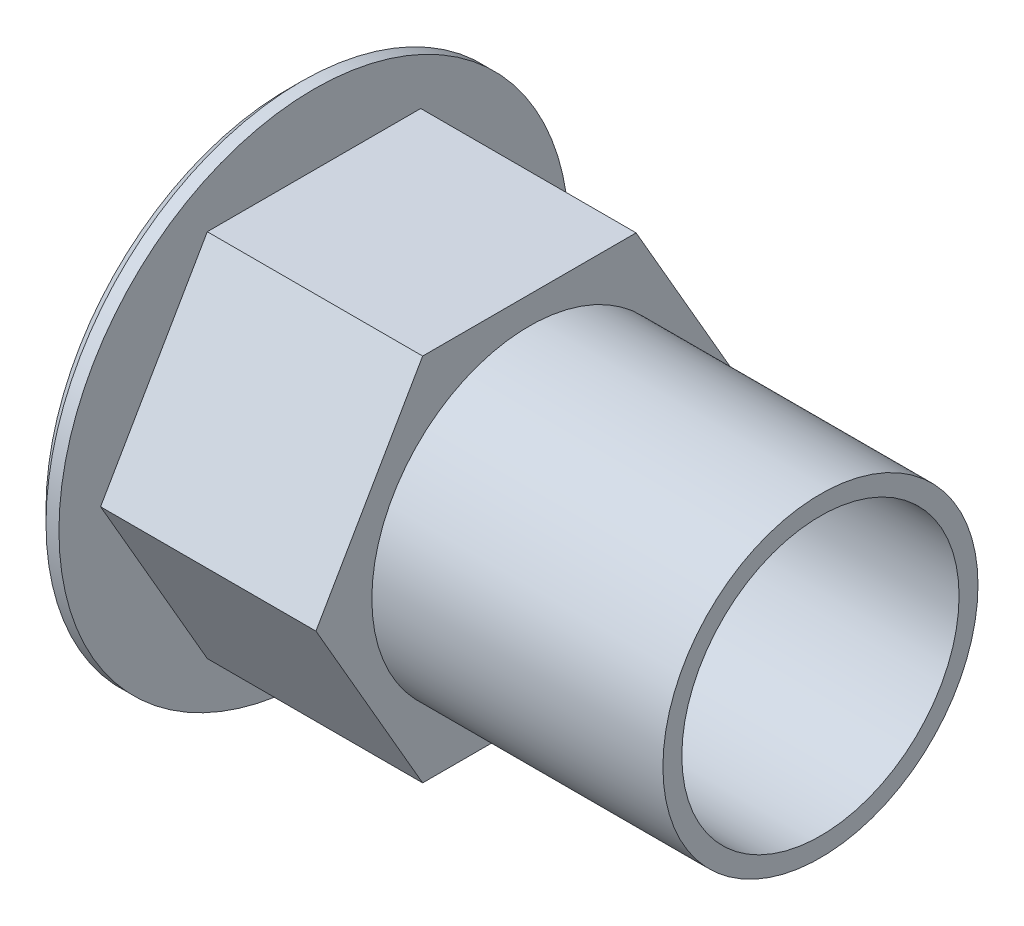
ISO-10303-21;
HEADER;
FILE_DESCRIPTION(('STEP AP214'),'2;1');
FILE_NAME('part.step','',(''),(''),'','','');
FILE_SCHEMA(('AUTOMOTIVE_DESIGN { 1 0 10303 214 1 1 1 1 }'));
ENDSEC;
DATA;
#1=APPLICATION_CONTEXT('core data for automotive mechanical design processes');
#2=APPLICATION_PROTOCOL_DEFINITION('international standard','automotive_design',2000,#1);
#3=PRODUCT_CONTEXT('',#1,'mechanical');
#4=PRODUCT('Part','Part','',(#3));
#5=PRODUCT_RELATED_PRODUCT_CATEGORY('part','',(#4));
#6=PRODUCT_DEFINITION_FORMATION('','',#4);
#7=PRODUCT_DEFINITION_CONTEXT('part definition',#1,'design');
#8=PRODUCT_DEFINITION('design','',#6,#7);
#9=PRODUCT_DEFINITION_SHAPE('','',#8);
#10=(LENGTH_UNIT() NAMED_UNIT(*) SI_UNIT(.MILLI.,.METRE.));
#11=(NAMED_UNIT(*) PLANE_ANGLE_UNIT() SI_UNIT($,.RADIAN.));
#12=(NAMED_UNIT(*) SI_UNIT($,.STERADIAN.) SOLID_ANGLE_UNIT());
#13=UNCERTAINTY_MEASURE_WITH_UNIT(LENGTH_MEASURE(1.E-05),#10,'distance_accuracy_value','');
#14=(GEOMETRIC_REPRESENTATION_CONTEXT(3) GLOBAL_UNCERTAINTY_ASSIGNED_CONTEXT((#13)) GLOBAL_UNIT_ASSIGNED_CONTEXT((#10,
#11,#12)) REPRESENTATION_CONTEXT('',''));
#15=CARTESIAN_POINT('',(0.,0.,0.));
#16=DIRECTION('',(0.,0.,1.));
#17=DIRECTION('',(1.,0.,0.));
#18=AXIS2_PLACEMENT_3D('',#15,#16,#17);
#19=CARTESIAN_POINT('',(0.889,8.763,0.));
#20=DIRECTION('',(-1.,0.,0.));
#21=DIRECTION('',(0.,0.,1.));
#22=AXIS2_PLACEMENT_3D('',#19,#20,#21);
#23=PLANE('',#22);
#24=CARTESIAN_POINT('',(0.889,0.,0.));
#25=DIRECTION('',(-1.,0.,0.));
#26=DIRECTION('',(0.,0.,1.));
#27=AXIS2_PLACEMENT_3D('',#24,#25,#26);
#28=CIRCLE('',#27,8.763);
#29=CARTESIAN_POINT('',(0.889,0.,8.763));
#30=VERTEX_POINT('',#29);
#31=EDGE_CURVE('E137',#30,#30,#28,.T.);
#32=ORIENTED_EDGE('',*,*,#31,.F.);
#33=EDGE_LOOP('',(#32));
#34=FACE_BOUND('',#33,.T.);
#35=DIRECTION('',(0.,0.866025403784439,-0.5));
#36=VECTOR('',#35,1.);
#37=CARTESIAN_POINT('',(0.889,-6.35,-3.66617420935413));
#38=LINE('',#37,#36);
#39=CARTESIAN_POINT('',(0.889,-6.35,-3.66617420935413));
#40=VERTEX_POINT('',#39);
#41=CARTESIAN_POINT('',(0.889,0.,-7.33234841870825));
#42=VERTEX_POINT('',#41);
#43=EDGE_CURVE('E85',#40,#42,#38,.T.);
#44=ORIENTED_EDGE('',*,*,#43,.F.);
#45=DIRECTION('',(0.,0.,-1.));
#46=VECTOR('',#45,1.);
#47=CARTESIAN_POINT('',(0.889,-6.35,3.66617420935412));
#48=LINE('',#47,#46);
#49=CARTESIAN_POINT('',(0.889,-6.35,3.66617420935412));
#50=VERTEX_POINT('',#49);
#51=EDGE_CURVE('E87',#50,#40,#48,.T.);
#52=ORIENTED_EDGE('',*,*,#51,.F.);
#53=DIRECTION('',(0.,-0.866025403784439,-0.5));
#54=VECTOR('',#53,1.);
#55=CARTESIAN_POINT('',(0.889,0.,7.33234841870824));
#56=LINE('',#55,#54);
#57=CARTESIAN_POINT('',(0.889,0.,7.33234841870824));
#58=VERTEX_POINT('',#57);
#59=EDGE_CURVE('E103',#58,#50,#56,.T.);
#60=ORIENTED_EDGE('',*,*,#59,.F.);
#61=DIRECTION('',(0.,-0.866025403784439,0.5));
#62=VECTOR('',#61,1.);
#63=CARTESIAN_POINT('',(0.889,6.35,3.66617420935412));
#64=LINE('',#63,#62);
#65=CARTESIAN_POINT('',(0.889,6.35,3.66617420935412));
#66=VERTEX_POINT('',#65);
#67=EDGE_CURVE('E210',#66,#58,#64,.T.);
#68=ORIENTED_EDGE('',*,*,#67,.F.);
#69=DIRECTION('',(0.,0.,1.));
#70=VECTOR('',#69,1.);
#71=CARTESIAN_POINT('',(0.889,6.35,-3.66617420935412));
#72=LINE('',#71,#70);
#73=CARTESIAN_POINT('',(0.889,6.35,-3.66617420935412));
#74=VERTEX_POINT('',#73);
#75=EDGE_CURVE('E56',#74,#66,#72,.T.);
#76=ORIENTED_EDGE('',*,*,#75,.F.);
#77=DIRECTION('',(0.,0.866025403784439,0.5));
#78=VECTOR('',#77,1.);
#79=CARTESIAN_POINT('',(0.889,0.,-7.33234841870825));
#80=LINE('',#79,#78);
#81=EDGE_CURVE('E51',#42,#74,#80,.T.);
#82=ORIENTED_EDGE('',*,*,#81,.F.);
#83=EDGE_LOOP('',(#44,#52,#60,#68,#76,#82));
#84=FACE_BOUND('',#83,.T.);
#85=ADVANCED_FACE('F36',(#34,#84),#23,.F.);
#86=CARTESIAN_POINT('',(0.,0.,0.));
#87=DIRECTION('',(-1.,0.,0.));
#88=DIRECTION('',(0.,0.,1.));
#89=AXIS2_PLACEMENT_3D('',#86,#87,#88);
#90=CYLINDRICAL_SURFACE('',#89,5.4125);
#91=CARTESIAN_POINT('',(18.288,0.,0.));
#92=DIRECTION('',(-1.,0.,0.));
#93=DIRECTION('',(0.,0.,1.));
#94=AXIS2_PLACEMENT_3D('',#91,#92,#93);
#95=CIRCLE('',#94,5.4125);
#96=CARTESIAN_POINT('',(18.288,0.,5.4125));
#97=VERTEX_POINT('',#96);
#98=EDGE_CURVE('E134',#97,#97,#95,.T.);
#99=ORIENTED_EDGE('',*,*,#98,.T.);
#100=EDGE_LOOP('',(#99));
#101=FACE_BOUND('',#100,.T.);
#102=CARTESIAN_POINT('',(8.288,0.,0.));
#103=DIRECTION('',(-1.,0.,0.));
#104=DIRECTION('',(0.,0.,1.));
#105=AXIS2_PLACEMENT_3D('',#102,#103,#104);
#106=CIRCLE('',#105,5.4125);
#107=CARTESIAN_POINT('',(8.288,0.,5.4125));
#108=VERTEX_POINT('',#107);
#109=EDGE_CURVE('E11',#108,#108,#106,.T.);
#110=ORIENTED_EDGE('',*,*,#109,.F.);
#111=EDGE_LOOP('',(#110));
#112=FACE_BOUND('',#111,.T.);
#113=ADVANCED_FACE('F150',(#101,#112),#90,.T.);
#114=CARTESIAN_POINT('',(0.4445,0.,0.));
#115=DIRECTION('',(1.,0.,0.));
#116=DIRECTION('',(0.,0.,-1.));
#117=AXIS2_PLACEMENT_3D('',#114,#115,#116);
#118=CONICAL_SURFACE('',#117,8.763,0.785398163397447);
#119=CARTESIAN_POINT('',(0.,0.,0.));
#120=DIRECTION('',(-1.,0.,0.));
#121=DIRECTION('',(0.,0.,1.));
#122=AXIS2_PLACEMENT_3D('',#119,#120,#121);
#123=CIRCLE('',#122,8.3185);
#124=CARTESIAN_POINT('',(0.,0.,8.3185));
#125=VERTEX_POINT('',#124);
#126=EDGE_CURVE('E125',#125,#125,#123,.T.);
#127=ORIENTED_EDGE('',*,*,#126,.F.);
#128=EDGE_LOOP('',(#127));
#129=FACE_BOUND('',#128,.T.);
#130=CARTESIAN_POINT('',(0.4445,0.,0.));
#131=DIRECTION('',(-1.,0.,0.));
#132=DIRECTION('',(0.,0.,1.));
#133=AXIS2_PLACEMENT_3D('',#130,#131,#132);
#134=CIRCLE('',#133,8.763);
#135=CARTESIAN_POINT('',(0.4445,0.,8.763));
#136=VERTEX_POINT('',#135);
#137=EDGE_CURVE('E44',#136,#136,#134,.T.);
#138=ORIENTED_EDGE('',*,*,#137,.T.);
#139=EDGE_LOOP('',(#138));
#140=FACE_BOUND('',#139,.T.);
#141=ADVANCED_FACE('F38',(#129,#140),#118,.T.);
#142=CARTESIAN_POINT('',(0.,0.,0.));
#143=DIRECTION('',(-1.,0.,0.));
#144=DIRECTION('',(0.,0.,1.));
#145=AXIS2_PLACEMENT_3D('',#142,#143,#144);
#146=CYLINDRICAL_SURFACE('',#145,8.763);
#147=ORIENTED_EDGE('',*,*,#137,.F.);
#148=EDGE_LOOP('',(#147));
#149=FACE_BOUND('',#148,.T.);
#150=ORIENTED_EDGE('',*,*,#31,.T.);
#151=EDGE_LOOP('',(#150));
#152=FACE_BOUND('',#151,.T.);
#153=ADVANCED_FACE('F143',(#149,#152),#146,.T.);
#154=CARTESIAN_POINT('',(18.288,5.4125,0.));
#155=DIRECTION('',(-1.,0.,0.));
#156=DIRECTION('',(0.,0.,1.));
#157=AXIS2_PLACEMENT_3D('',#154,#155,#156);
#158=PLANE('',#157);
#159=ORIENTED_EDGE('',*,*,#98,.F.);
#160=EDGE_LOOP('',(#159));
#161=FACE_BOUND('',#160,.T.);
#162=CARTESIAN_POINT('',(18.288,0.,0.));
#163=DIRECTION('',(-1.,0.,0.));
#164=DIRECTION('',(0.,0.,1.));
#165=AXIS2_PLACEMENT_3D('',#162,#163,#164);
#166=CIRCLE('',#165,4.7625);
#167=CARTESIAN_POINT('',(18.288,0.,4.7625));
#168=VERTEX_POINT('',#167);
#169=EDGE_CURVE('E131',#168,#168,#166,.T.);
#170=ORIENTED_EDGE('',*,*,#169,.T.);
#171=EDGE_LOOP('',(#170));
#172=FACE_BOUND('',#171,.T.);
#173=ADVANCED_FACE('F146',(#161,#172),#158,.F.);
#174=CARTESIAN_POINT('',(0.,0.,0.));
#175=DIRECTION('',(-1.,0.,0.));
#176=DIRECTION('',(0.,0.,1.));
#177=AXIS2_PLACEMENT_3D('',#174,#175,#176);
#178=CYLINDRICAL_SURFACE('',#177,4.7625);
#179=ORIENTED_EDGE('',*,*,#169,.F.);
#180=EDGE_LOOP('',(#179));
#181=FACE_BOUND('',#180,.T.);
#182=CARTESIAN_POINT('',(0.,0.,0.));
#183=DIRECTION('',(-1.,0.,0.));
#184=DIRECTION('',(0.,0.,1.));
#185=AXIS2_PLACEMENT_3D('',#182,#183,#184);
#186=CIRCLE('',#185,4.7625);
#187=CARTESIAN_POINT('',(0.,0.,4.7625));
#188=VERTEX_POINT('',#187);
#189=EDGE_CURVE('E128',#188,#188,#186,.T.);
#190=ORIENTED_EDGE('',*,*,#189,.T.);
#191=EDGE_LOOP('',(#190));
#192=FACE_BOUND('',#191,.T.);
#193=ADVANCED_FACE('F160',(#181,#192),#178,.F.);
#194=CARTESIAN_POINT('',(0.,4.7625,0.));
#195=DIRECTION('',(1.,0.,0.));
#196=DIRECTION('',(0.,0.,-1.));
#197=AXIS2_PLACEMENT_3D('',#194,#195,#196);
#198=PLANE('',#197);
#199=ORIENTED_EDGE('',*,*,#189,.F.);
#200=EDGE_LOOP('',(#199));
#201=FACE_BOUND('',#200,.T.);
#202=ORIENTED_EDGE('',*,*,#126,.T.);
#203=EDGE_LOOP('',(#202));
#204=FACE_BOUND('',#203,.T.);
#205=ADVANCED_FACE('F164',(#201,#204),#198,.F.);
#206=CARTESIAN_POINT('',(8.288,-6.35,-3.66617420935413));
#207=DIRECTION('',(-1.,0.,0.));
#208=DIRECTION('',(0.,0.,1.));
#209=AXIS2_PLACEMENT_3D('',#206,#207,#208);
#210=PLANE('',#209);
#211=DIRECTION('',(0.,0.866025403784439,-0.5));
#212=VECTOR('',#211,1.);
#213=CARTESIAN_POINT('',(8.288,-6.35,-3.66617420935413));
#214=LINE('',#213,#212);
#215=CARTESIAN_POINT('',(8.288,-6.35,-3.66617420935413));
#216=VERTEX_POINT('',#215);
#217=CARTESIAN_POINT('',(8.288,0.,-7.33234841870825));
#218=VERTEX_POINT('',#217);
#219=EDGE_CURVE('E102',#216,#218,#214,.T.);
#220=ORIENTED_EDGE('',*,*,#219,.T.);
#221=DIRECTION('',(0.,0.866025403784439,0.5));
#222=VECTOR('',#221,1.);
#223=CARTESIAN_POINT('',(8.288,0.,-7.33234841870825));
#224=LINE('',#223,#222);
#225=CARTESIAN_POINT('',(8.288,6.35,-3.66617420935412));
#226=VERTEX_POINT('',#225);
#227=EDGE_CURVE('E197',#218,#226,#224,.T.);
#228=ORIENTED_EDGE('',*,*,#227,.T.);
#229=DIRECTION('',(0.,0.,1.));
#230=VECTOR('',#229,1.);
#231=CARTESIAN_POINT('',(8.288,6.35,-3.66617420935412));
#232=LINE('',#231,#230);
#233=CARTESIAN_POINT('',(8.288,6.35,3.66617420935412));
#234=VERTEX_POINT('',#233);
#235=EDGE_CURVE('E201',#226,#234,#232,.T.);
#236=ORIENTED_EDGE('',*,*,#235,.T.);
#237=DIRECTION('',(0.,-0.866025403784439,0.5));
#238=VECTOR('',#237,1.);
#239=CARTESIAN_POINT('',(8.288,6.35,3.66617420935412));
#240=LINE('',#239,#238);
#241=CARTESIAN_POINT('',(8.288,0.,7.33234841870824));
#242=VERTEX_POINT('',#241);
#243=EDGE_CURVE('E203',#234,#242,#240,.T.);
#244=ORIENTED_EDGE('',*,*,#243,.T.);
#245=DIRECTION('',(0.,-0.866025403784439,-0.5));
#246=VECTOR('',#245,1.);
#247=CARTESIAN_POINT('',(8.288,0.,7.33234841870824));
#248=LINE('',#247,#246);
#249=CARTESIAN_POINT('',(8.288,-6.35,3.66617420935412));
#250=VERTEX_POINT('',#249);
#251=EDGE_CURVE('E111',#242,#250,#248,.T.);
#252=ORIENTED_EDGE('',*,*,#251,.T.);
#253=DIRECTION('',(0.,0.,-1.));
#254=VECTOR('',#253,1.);
#255=CARTESIAN_POINT('',(8.288,-6.35,3.66617420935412));
#256=LINE('',#255,#254);
#257=EDGE_CURVE('E107',#250,#216,#256,.T.);
#258=ORIENTED_EDGE('',*,*,#257,.T.);
#259=EDGE_LOOP('',(#220,#228,#236,#244,#252,#258));
#260=FACE_BOUND('',#259,.T.);
#261=ORIENTED_EDGE('',*,*,#109,.T.);
#262=EDGE_LOOP('',(#261));
#263=FACE_BOUND('',#262,.T.);
#264=ADVANCED_FACE('F168',(#260,#263),#210,.F.);
#265=CARTESIAN_POINT('',(8.288,-6.35,-3.66617420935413));
#266=DIRECTION('',(0.,0.5,0.866025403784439));
#267=DIRECTION('',(0.,-0.866025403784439,0.5));
#268=AXIS2_PLACEMENT_3D('',#265,#266,#267);
#269=PLANE('',#268);
#270=ORIENTED_EDGE('',*,*,#43,.T.);
#271=DIRECTION('',(-1.,0.,0.));
#272=VECTOR('',#271,1.);
#273=CARTESIAN_POINT('',(8.288,0.,-7.33234841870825));
#274=LINE('',#273,#272);
#275=EDGE_CURVE('E123',#218,#42,#274,.T.);
#276=ORIENTED_EDGE('',*,*,#275,.F.);
#277=ORIENTED_EDGE('',*,*,#219,.F.);
#278=DIRECTION('',(-1.,0.,0.));
#279=VECTOR('',#278,1.);
#280=CARTESIAN_POINT('',(8.288,-6.35,-3.66617420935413));
#281=LINE('',#280,#279);
#282=EDGE_CURVE('E98',#216,#40,#281,.T.);
#283=ORIENTED_EDGE('',*,*,#282,.T.);
#284=EDGE_LOOP('',(#270,#276,#277,#283));
#285=FACE_BOUND('',#284,.T.);
#286=ADVANCED_FACE('F105',(#285),#269,.F.);
#287=CARTESIAN_POINT('',(8.288,0.,-7.33234841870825));
#288=DIRECTION('',(0.,-0.5,0.866025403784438));
#289=DIRECTION('',(0.,-0.866025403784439,-0.5));
#290=AXIS2_PLACEMENT_3D('',#287,#288,#289);
#291=PLANE('',#290);
#292=ORIENTED_EDGE('',*,*,#81,.T.);
#293=DIRECTION('',(-1.,0.,0.));
#294=VECTOR('',#293,1.);
#295=CARTESIAN_POINT('',(8.288,6.35,-3.66617420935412));
#296=LINE('',#295,#294);
#297=EDGE_CURVE('E120',#226,#74,#296,.T.);
#298=ORIENTED_EDGE('',*,*,#297,.F.);
#299=ORIENTED_EDGE('',*,*,#227,.F.);
#300=ORIENTED_EDGE('',*,*,#275,.T.);
#301=EDGE_LOOP('',(#292,#298,#299,#300));
#302=FACE_BOUND('',#301,.T.);
#303=ADVANCED_FACE('F172',(#302),#291,.F.);
#304=CARTESIAN_POINT('',(8.288,6.35,-3.66617420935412));
#305=DIRECTION('',(0.,-1.,0.));
#306=DIRECTION('',(0.,0.,-1.));
#307=AXIS2_PLACEMENT_3D('',#304,#305,#306);
#308=PLANE('',#307);
#309=ORIENTED_EDGE('',*,*,#75,.T.);
#310=DIRECTION('',(-1.,0.,0.));
#311=VECTOR('',#310,1.);
#312=CARTESIAN_POINT('',(8.288,6.35,3.66617420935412));
#313=LINE('',#312,#311);
#314=EDGE_CURVE('E117',#234,#66,#313,.T.);
#315=ORIENTED_EDGE('',*,*,#314,.F.);
#316=ORIENTED_EDGE('',*,*,#235,.F.);
#317=ORIENTED_EDGE('',*,*,#297,.T.);
#318=EDGE_LOOP('',(#309,#315,#316,#317));
#319=FACE_BOUND('',#318,.T.);
#320=ADVANCED_FACE('F175',(#319),#308,.F.);
#321=CARTESIAN_POINT('',(8.288,6.35,3.66617420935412));
#322=DIRECTION('',(0.,-0.5,-0.866025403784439));
#323=DIRECTION('',(0.,0.866025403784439,-0.5));
#324=AXIS2_PLACEMENT_3D('',#321,#322,#323);
#325=PLANE('',#324);
#326=ORIENTED_EDGE('',*,*,#67,.T.);
#327=DIRECTION('',(-1.,0.,0.));
#328=VECTOR('',#327,1.);
#329=CARTESIAN_POINT('',(8.288,0.,7.33234841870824));
#330=LINE('',#329,#328);
#331=EDGE_CURVE('E109',#242,#58,#330,.T.);
#332=ORIENTED_EDGE('',*,*,#331,.F.);
#333=ORIENTED_EDGE('',*,*,#243,.F.);
#334=ORIENTED_EDGE('',*,*,#314,.T.);
#335=EDGE_LOOP('',(#326,#332,#333,#334));
#336=FACE_BOUND('',#335,.T.);
#337=ADVANCED_FACE('F179',(#336),#325,.F.);
#338=CARTESIAN_POINT('',(8.288,0.,7.33234841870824));
#339=DIRECTION('',(0.,0.5,-0.866025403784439));
#340=DIRECTION('',(0.,0.866025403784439,0.5));
#341=AXIS2_PLACEMENT_3D('',#338,#339,#340);
#342=PLANE('',#341);
#343=ORIENTED_EDGE('',*,*,#59,.T.);
#344=DIRECTION('',(-1.,0.,0.));
#345=VECTOR('',#344,1.);
#346=CARTESIAN_POINT('',(8.288,-6.35,3.66617420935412));
#347=LINE('',#346,#345);
#348=EDGE_CURVE('E101',#250,#50,#347,.T.);
#349=ORIENTED_EDGE('',*,*,#348,.F.);
#350=ORIENTED_EDGE('',*,*,#251,.F.);
#351=ORIENTED_EDGE('',*,*,#331,.T.);
#352=EDGE_LOOP('',(#343,#349,#350,#351));
#353=FACE_BOUND('',#352,.T.);
#354=ADVANCED_FACE('F183',(#353),#342,.F.);
#355=CARTESIAN_POINT('',(8.288,-6.35,3.66617420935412));
#356=DIRECTION('',(0.,1.,0.));
#357=DIRECTION('',(0.,0.,1.));
#358=AXIS2_PLACEMENT_3D('',#355,#356,#357);
#359=PLANE('',#358);
#360=ORIENTED_EDGE('',*,*,#51,.T.);
#361=ORIENTED_EDGE('',*,*,#282,.F.);
#362=ORIENTED_EDGE('',*,*,#257,.F.);
#363=ORIENTED_EDGE('',*,*,#348,.T.);
#364=EDGE_LOOP('',(#360,#361,#362,#363));
#365=FACE_BOUND('',#364,.T.);
#366=ADVANCED_FACE('F96',(#365),#359,.F.);
#367=CLOSED_SHELL('',(#85,#113,#141,#153,#173,#193,#205,#264,#286,#303,#320,#337,#354,#366));
#368=MANIFOLD_SOLID_BREP('B2',#367);
#369=ADVANCED_BREP_SHAPE_REPRESENTATION('',(#18,#368),#14);
#370=SHAPE_DEFINITION_REPRESENTATION(#9,#369);
ENDSEC;
END-ISO-10303-21;
